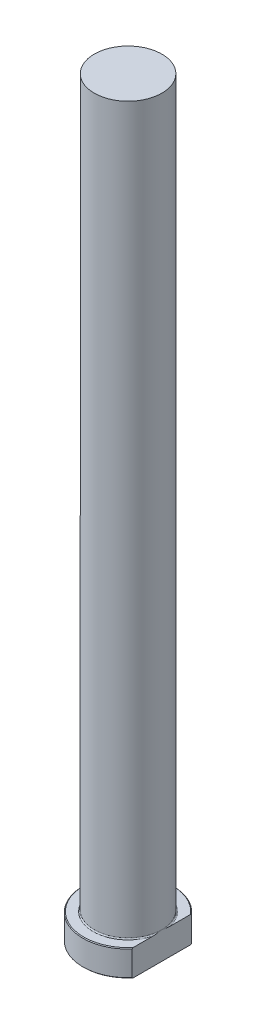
ISO-10303-21;
HEADER;
FILE_DESCRIPTION(('STEP AP214'),'2;1');
FILE_NAME('part.step','',(''),(''),'','','');
FILE_SCHEMA(('AUTOMOTIVE_DESIGN { 1 0 10303 214 1 1 1 1 }'));
ENDSEC;
DATA;
#1=APPLICATION_CONTEXT('core data for automotive mechanical design processes');
#2=APPLICATION_PROTOCOL_DEFINITION('international standard','automotive_design',2000,#1);
#3=PRODUCT_CONTEXT('',#1,'mechanical');
#4=PRODUCT('Part','Part','',(#3));
#5=PRODUCT_RELATED_PRODUCT_CATEGORY('part','',(#4));
#6=PRODUCT_DEFINITION_FORMATION('','',#4);
#7=PRODUCT_DEFINITION_CONTEXT('part definition',#1,'design');
#8=PRODUCT_DEFINITION('design','',#6,#7);
#9=PRODUCT_DEFINITION_SHAPE('','',#8);
#10=(LENGTH_UNIT() NAMED_UNIT(*) SI_UNIT(.MILLI.,.METRE.));
#11=(NAMED_UNIT(*) PLANE_ANGLE_UNIT() SI_UNIT($,.RADIAN.));
#12=(NAMED_UNIT(*) SI_UNIT($,.STERADIAN.) SOLID_ANGLE_UNIT());
#13=UNCERTAINTY_MEASURE_WITH_UNIT(LENGTH_MEASURE(1.E-05),#10,'distance_accuracy_value','');
#14=(GEOMETRIC_REPRESENTATION_CONTEXT(3) GLOBAL_UNCERTAINTY_ASSIGNED_CONTEXT((#13)) GLOBAL_UNIT_ASSIGNED_CONTEXT((#10,
#11,#12)) REPRESENTATION_CONTEXT('',''));
#15=CARTESIAN_POINT('',(0.,0.,0.));
#16=DIRECTION('',(0.,0.,1.));
#17=DIRECTION('',(1.,0.,0.));
#18=AXIS2_PLACEMENT_3D('',#15,#16,#17);
#19=CARTESIAN_POINT('',(0.,0.,0.));
#20=DIRECTION('',(0.,-1.,0.));
#21=DIRECTION('',(0.,0.,-1.));
#22=AXIS2_PLACEMENT_3D('',#19,#20,#21);
#23=PLANE('',#22);
#24=CARTESIAN_POINT('',(0.,0.,0.));
#25=DIRECTION('',(0.,-1.,0.));
#26=DIRECTION('',(0.,0.,-1.));
#27=AXIS2_PLACEMENT_3D('',#24,#25,#26);
#28=CIRCLE('',#27,11.8);
#29=CARTESIAN_POINT('',(8.99999999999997,0.,7.63151361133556));
#30=VERTEX_POINT('',#29);
#31=CARTESIAN_POINT('',(8.99999999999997,0.,-7.63151361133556));
#32=VERTEX_POINT('',#31);
#33=EDGE_CURVE('E98',#30,#32,#28,.T.);
#34=ORIENTED_EDGE('',*,*,#33,.T.);
#35=DIRECTION('',(0.,0.,1.));
#36=VECTOR('',#35,1.);
#37=CARTESIAN_POINT('',(8.99999999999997,0.,-7.93725393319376));
#38=LINE('',#37,#36);
#39=EDGE_CURVE('E83',#32,#30,#38,.T.);
#40=ORIENTED_EDGE('',*,*,#39,.T.);
#41=EDGE_LOOP('',(#34,#40));
#42=FACE_BOUND('',#41,.T.);
#43=ADVANCED_FACE('F32',(#42),#23,.T.);
#44=CARTESIAN_POINT('',(0.,259.958771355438,0.));
#45=DIRECTION('',(0.,1.,0.));
#46=DIRECTION('',(0.,0.,1.));
#47=AXIS2_PLACEMENT_3D('',#44,#45,#46);
#48=CYLINDRICAL_SURFACE('',#47,12.);
#49=CARTESIAN_POINT('',(0.,6.79999999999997,0.));
#50=DIRECTION('',(0.,1.,0.));
#51=DIRECTION('',(0.,0.,1.));
#52=AXIS2_PLACEMENT_3D('',#49,#50,#51);
#53=CIRCLE('',#52,12.);
#54=CARTESIAN_POINT('',(8.99999999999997,6.79999999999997,7.93725393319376));
#55=VERTEX_POINT('',#54);
#56=CARTESIAN_POINT('',(8.99999999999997,6.79999999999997,-7.93725393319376));
#57=VERTEX_POINT('',#56);
#58=EDGE_CURVE('E104',#55,#57,#53,.F.);
#59=ORIENTED_EDGE('',*,*,#58,.T.);
#60=DIRECTION('',(0.,-1.,0.));
#61=VECTOR('',#60,1.);
#62=CARTESIAN_POINT('',(8.99999999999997,200.,-7.93725393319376));
#63=LINE('',#62,#61);
#64=CARTESIAN_POINT('',(8.99999999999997,0.199999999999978,-7.93725393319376));
#65=VERTEX_POINT('',#64);
#66=EDGE_CURVE('E183',#57,#65,#63,.T.);
#67=ORIENTED_EDGE('',*,*,#66,.T.);
#68=CARTESIAN_POINT('',(0.,0.199999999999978,0.));
#69=DIRECTION('',(0.,-1.,0.));
#70=DIRECTION('',(0.,0.,-1.));
#71=AXIS2_PLACEMENT_3D('',#68,#69,#70);
#72=CIRCLE('',#71,12.);
#73=CARTESIAN_POINT('',(8.99999999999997,0.199999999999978,7.93725393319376));
#74=VERTEX_POINT('',#73);
#75=EDGE_CURVE('E100',#65,#74,#72,.F.);
#76=ORIENTED_EDGE('',*,*,#75,.T.);
#77=DIRECTION('',(0.,-1.,0.));
#78=VECTOR('',#77,1.);
#79=CARTESIAN_POINT('',(8.99999999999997,200.,7.93725393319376));
#80=LINE('',#79,#78);
#81=EDGE_CURVE('E93',#55,#74,#80,.T.);
#82=ORIENTED_EDGE('',*,*,#81,.F.);
#83=EDGE_LOOP('',(#59,#67,#76,#82));
#84=FACE_BOUND('',#83,.T.);
#85=ADVANCED_FACE('F158',(#84),#48,.T.);
#86=CARTESIAN_POINT('',(-12.,7.,0.));
#87=DIRECTION('',(0.,1.,0.));
#88=DIRECTION('',(0.,0.,1.));
#89=AXIS2_PLACEMENT_3D('',#86,#87,#88);
#90=PLANE('',#89);
#91=CARTESIAN_POINT('',(0.,7.,0.));
#92=DIRECTION('',(0.,1.,0.));
#93=DIRECTION('',(0.,0.,1.));
#94=AXIS2_PLACEMENT_3D('',#91,#92,#93);
#95=CIRCLE('',#94,11.8);
#96=CARTESIAN_POINT('',(8.99999999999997,7.,-7.63151361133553));
#97=VERTEX_POINT('',#96);
#98=CARTESIAN_POINT('',(8.99999999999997,7.,7.63151361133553));
#99=VERTEX_POINT('',#98);
#100=EDGE_CURVE('E178',#97,#99,#95,.T.);
#101=ORIENTED_EDGE('',*,*,#100,.T.);
#102=DIRECTION('',(0.,0.,-1.));
#103=VECTOR('',#102,1.);
#104=CARTESIAN_POINT('',(8.99999999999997,7.,0.));
#105=LINE('',#104,#103);
#106=CARTESIAN_POINT('',(8.99999999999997,6.99999999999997,2.34307490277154));
#107=VERTEX_POINT('',#106);
#108=EDGE_CURVE('E57',#99,#107,#105,.T.);
#109=ORIENTED_EDGE('',*,*,#108,.T.);
#110=CARTESIAN_POINT('',(0.,7.,0.));
#111=DIRECTION('',(0.,1.,0.));
#112=DIRECTION('',(0.,0.,1.));
#113=AXIS2_PLACEMENT_3D('',#110,#111,#112);
#114=CIRCLE('',#113,9.29999999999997);
#115=CARTESIAN_POINT('',(8.99999999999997,6.99999999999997,-2.34307490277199));
#116=VERTEX_POINT('',#115);
#117=EDGE_CURVE('E107',#107,#116,#114,.F.);
#118=ORIENTED_EDGE('',*,*,#117,.T.);
#119=EDGE_CURVE('E136',#116,#97,#105,.T.);
#120=ORIENTED_EDGE('',*,*,#119,.T.);
#121=EDGE_LOOP('',(#101,#109,#118,#120));
#122=FACE_BOUND('',#121,.T.);
#123=ADVANCED_FACE('F147',(#122),#90,.T.);
#124=CARTESIAN_POINT('',(0.,7.00000000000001,0.));
#125=DIRECTION('',(0.,-1.,0.));
#126=DIRECTION('',(0.,0.,-1.));
#127=AXIS2_PLACEMENT_3D('',#124,#125,#126);
#128=CONICAL_SURFACE('',#127,11.7999999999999,0.785398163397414);
#129=ORIENTED_EDGE('',*,*,#58,.F.);
#130=CARTESIAN_POINT('',(8.99999999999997,-0.845696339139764,17.4629145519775));
#131=CARTESIAN_POINT('',(8.99999999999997,-0.619168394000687,17.2080654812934));
#132=CARTESIAN_POINT('',(8.99999999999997,-0.393215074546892,16.9527052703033));
#133=CARTESIAN_POINT('',(8.99999999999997,0.0573779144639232,16.4408231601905));
#134=CARTESIAN_POINT('',(8.99999999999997,0.282017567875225,16.1843012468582));
#135=CARTESIAN_POINT('',(8.99999999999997,0.953874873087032,15.4126051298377));
#136=CARTESIAN_POINT('',(8.99999999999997,1.39886493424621,14.8954867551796));
#137=CARTESIAN_POINT('',(8.99999999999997,2.28707339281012,13.8475750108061));
#138=CARTESIAN_POINT('',(8.99999999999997,2.73018564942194,13.3166913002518));
#139=CARTESIAN_POINT('',(8.99999999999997,3.38667359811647,12.5137605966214));
#140=CARTESIAN_POINT('',(8.99999999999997,3.60411991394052,12.2450411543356));
#141=CARTESIAN_POINT('',(8.99999999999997,4.03580182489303,11.7050379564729));
#142=CARTESIAN_POINT('',(8.99999999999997,4.25003746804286,11.4337542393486));
#143=CARTESIAN_POINT('',(8.99999999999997,4.66485476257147,10.9008707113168));
#144=CARTESIAN_POINT('',(8.99999999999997,4.8656088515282,10.6394052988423));
#145=CARTESIAN_POINT('',(8.99999999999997,5.26299613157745,10.1133666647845));
#146=CARTESIAN_POINT('',(8.99999999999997,5.45962943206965,9.84879352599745));
#147=CARTESIAN_POINT('',(8.99999999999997,5.84808590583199,9.31586751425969));
#148=CARTESIAN_POINT('',(8.99999999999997,6.039905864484,9.04751229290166));
#149=CARTESIAN_POINT('',(8.99999999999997,6.41755379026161,8.5066135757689));
#150=CARTESIAN_POINT('',(8.99999999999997,6.60338186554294,8.23407015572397));
#151=CARTESIAN_POINT('',(8.99999999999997,6.96709703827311,7.68503423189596));
#152=CARTESIAN_POINT('',(8.99999999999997,7.14500871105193,7.40855806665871));
#153=CARTESIAN_POINT('',(8.99999999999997,7.49185621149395,6.84996824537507));
#154=CARTESIAN_POINT('',(8.99999999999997,7.66079116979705,6.56785404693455));
#155=CARTESIAN_POINT('',(8.99999999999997,7.98727106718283,5.99747808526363));
#156=CARTESIAN_POINT('',(8.99999999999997,8.14482812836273,5.70922330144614));
#157=CARTESIAN_POINT('',(8.99999999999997,8.4458607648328,5.12549650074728));
#158=CARTESIAN_POINT('',(8.99999999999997,8.58934045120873,4.83002662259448));
#159=CARTESIAN_POINT('',(8.99999999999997,8.84906483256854,4.25238874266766));
#160=CARTESIAN_POINT('',(8.99999999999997,8.96652090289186,3.97076984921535));
#161=CARTESIAN_POINT('',(8.99999999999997,9.1826864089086,3.40034514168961));
#162=CARTESIAN_POINT('',(8.99999999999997,9.28139598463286,3.1115393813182));
#163=CARTESIAN_POINT('',(8.99999999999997,9.4556676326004,2.52852903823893));
#164=CARTESIAN_POINT('',(8.99999999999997,9.53134480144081,2.23435935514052));
#165=CARTESIAN_POINT('',(8.99999999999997,9.65632576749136,1.64041484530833));
#166=CARTESIAN_POINT('',(8.99999999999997,9.70563300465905,1.34064075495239));
#167=CARTESIAN_POINT('',(8.99999999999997,9.77526514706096,0.73345334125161));
#168=CARTESIAN_POINT('',(8.99999999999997,9.79517814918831,0.425991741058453));
#169=CARTESIAN_POINT('',(8.99999999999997,9.80326622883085,-0.189338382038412));
#170=CARTESIAN_POINT('',(8.99999999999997,9.7914430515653,-0.497206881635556));
#171=CARTESIAN_POINT('',(8.99999999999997,9.73685194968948,-1.11106012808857));
#172=CARTESIAN_POINT('',(8.99999999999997,9.69399186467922,-1.41703652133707));
#173=CARTESIAN_POINT('',(8.99999999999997,9.58011156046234,-2.02367348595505));
#174=CARTESIAN_POINT('',(8.99999999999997,9.50908374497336,-2.32433260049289));
#175=CARTESIAN_POINT('',(8.99999999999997,9.31275981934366,-3.02635448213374));
#176=CARTESIAN_POINT('',(8.99999999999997,9.17712713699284,-3.42480429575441));
#177=CARTESIAN_POINT('',(8.99999999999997,8.87133996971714,-4.20817933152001));
#178=CARTESIAN_POINT('',(8.99999999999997,8.70116358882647,-4.59309579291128));
#179=CARTESIAN_POINT('',(8.99999999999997,8.42568509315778,-5.16277807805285));
#180=CARTESIAN_POINT('',(8.99999999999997,8.32997694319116,-5.3522881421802));
#181=CARTESIAN_POINT('',(8.99999999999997,8.13285287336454,-5.72832390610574));
#182=CARTESIAN_POINT('',(8.99999999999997,8.03143692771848,-5.91484959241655));
#183=CARTESIAN_POINT('',(8.99999999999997,7.8237269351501,-6.28506428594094));
#184=CARTESIAN_POINT('',(8.99999999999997,7.71743466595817,-6.46875429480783));
#185=CARTESIAN_POINT('',(8.99999999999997,7.50059460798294,-6.83359939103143));
#186=CARTESIAN_POINT('',(8.99999999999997,7.39004682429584,-7.01475448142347));
#187=CARTESIAN_POINT('',(8.99999999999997,7.12884885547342,-7.4330641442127));
#188=CARTESIAN_POINT('',(8.99999999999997,6.9768081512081,-7.66934990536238));
#189=CARTESIAN_POINT('',(8.99999999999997,6.66732030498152,-8.13836281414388));
#190=CARTESIAN_POINT('',(8.99999999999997,6.50987281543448,-8.37108973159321));
#191=CARTESIAN_POINT('',(8.99999999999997,6.19040265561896,-8.83345273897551));
#192=CARTESIAN_POINT('',(8.99999999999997,6.02837897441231,-9.06308812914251));
#193=CARTESIAN_POINT('',(8.99999999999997,5.70047733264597,-9.51959402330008));
#194=CARTESIAN_POINT('',(8.99999999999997,5.53459926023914,-9.74646444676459));
#195=CARTESIAN_POINT('',(8.99999999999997,5.03154469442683,-10.4241247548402));
#196=CARTESIAN_POINT('',(8.99999999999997,4.68944039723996,-10.8712583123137));
#197=CARTESIAN_POINT('',(8.99999999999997,3.9955806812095,-11.7578381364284));
#198=CARTESIAN_POINT('',(8.99999999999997,3.64382644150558,-12.1972853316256));
#199=CARTESIAN_POINT('',(8.99999999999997,2.95317269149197,-13.0452636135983));
#200=CARTESIAN_POINT('',(8.99999999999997,2.61468309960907,-13.4541293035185));
#201=CARTESIAN_POINT('',(8.99999999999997,1.93249184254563,-14.2675092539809));
#202=CARTESIAN_POINT('',(8.99999999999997,1.58878996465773,-14.6720233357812));
#203=CARTESIAN_POINT('',(8.99999999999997,0.898519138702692,-15.4759626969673));
#204=CARTESIAN_POINT('',(8.99999999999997,0.551965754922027,-15.8754013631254));
#205=CARTESIAN_POINT('',(8.99999999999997,-0.144511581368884,-16.6712645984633));
#206=CARTESIAN_POINT('',(8.99999999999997,-0.494435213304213,-17.0676894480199));
#207=CARTESIAN_POINT('',(8.99999999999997,-0.845696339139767,-17.4629145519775));
#208=B_SPLINE_CURVE_WITH_KNOTS('',3,(#130,#131,#132,#133,#134,#135,#136,#137,#138,#139,#140,
#141,#142,#143,#144,#145,#146,#147,#148,#149,#150,#151,#152,#153,#154,#155,#156,#157,#158,#159,
#160,#161,#162,#163,#164,#165,#166,#167,#168,#169,#170,#171,#172,#173,#174,#175,#176,#177,#178,
#179,#180,#181,#182,#183,#184,#185,#186,#187,#188,#189,#190,#191,#192,#193,#194,#195,#196,#197,
#198,#199,#200,#201,#202,#203,#204,#205,#206,#207),.UNSPECIFIED.,.F.,.F.,(4,2,2,2,2,2,2,2,2,2,2,
2,2,2,2,2,2,2,2,2,2,2,2,2,2,2,2,2,2,2,2,2,2,2,2,2,2,2,4),(0.,1.02291971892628,2.04585198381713,
4.09246471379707,6.16687312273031,7.20388686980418,8.24088509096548,9.22978878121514,
10.2186661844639,11.2081873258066,12.197690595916,13.1838703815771,14.1701455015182,
15.1553538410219,16.1402736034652,17.0551241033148,17.9699677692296,18.8801617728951,
19.7902370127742,20.7129479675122,21.6356081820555,22.5610194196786,23.4866803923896,
24.7471780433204,26.0084771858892,26.6453205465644,27.2821667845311,27.9187826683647,
28.5553977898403,29.3982316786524,30.2411198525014,31.0841957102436,31.9272960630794,
33.6160766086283,35.3046517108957,36.8969911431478,38.4893957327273,40.0758348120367,
41.6621244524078),.UNSPECIFIED.);
#209=EDGE_CURVE('E135',#55,#99,#208,.T.);
#210=ORIENTED_EDGE('',*,*,#209,.T.);
#211=ORIENTED_EDGE('',*,*,#100,.F.);
#212=EDGE_CURVE('E127',#97,#57,#208,.T.);
#213=ORIENTED_EDGE('',*,*,#212,.T.);
#214=EDGE_LOOP('',(#129,#210,#211,#213));
#215=FACE_BOUND('',#214,.T.);
#216=ADVANCED_FACE('F143',(#215),#128,.T.);
#217=CARTESIAN_POINT('',(0.,0.199999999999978,0.));
#218=DIRECTION('',(0.,1.,0.));
#219=DIRECTION('',(0.,0.,1.));
#220=AXIS2_PLACEMENT_3D('',#217,#218,#219);
#221=CONICAL_SURFACE('',#220,12.,0.785398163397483);
#222=ORIENTED_EDGE('',*,*,#75,.F.);
#223=CARTESIAN_POINT('',(8.99999999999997,7.84569633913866,-17.4629145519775));
#224=CARTESIAN_POINT('',(8.99999999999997,7.61916839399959,-17.2080654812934));
#225=CARTESIAN_POINT('',(8.99999999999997,7.3932150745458,-16.9527052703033));
#226=CARTESIAN_POINT('',(8.99999999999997,6.94262208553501,-16.4408231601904));
#227=CARTESIAN_POINT('',(8.99999999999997,6.71798243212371,-16.1843012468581));
#228=CARTESIAN_POINT('',(8.99999999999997,6.04612512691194,-15.4126051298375));
#229=CARTESIAN_POINT('',(8.99999999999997,5.60113506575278,-14.8954867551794));
#230=CARTESIAN_POINT('',(8.99999999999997,4.71292660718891,-13.8475750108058));
#231=CARTESIAN_POINT('',(8.99999999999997,4.26981435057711,-13.3166913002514));
#232=CARTESIAN_POINT('',(8.99999999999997,3.6133264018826,-12.5137605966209));
#233=CARTESIAN_POINT('',(8.99999999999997,3.39588008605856,-12.245041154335));
#234=CARTESIAN_POINT('',(8.99999999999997,2.96419817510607,-11.7050379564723));
#235=CARTESIAN_POINT('',(8.99999999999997,2.74996253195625,-11.4337542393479));
#236=CARTESIAN_POINT('',(8.99999999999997,2.33514523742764,-10.9008707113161));
#237=CARTESIAN_POINT('',(8.99999999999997,2.1343911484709,-10.6394052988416));
#238=CARTESIAN_POINT('',(8.99999999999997,1.73700386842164,-10.1133666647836));
#239=CARTESIAN_POINT('',(8.99999999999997,1.54037056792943,-9.84879352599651));
#240=CARTESIAN_POINT('',(8.99999999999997,1.15191409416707,-9.31586751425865));
#241=CARTESIAN_POINT('',(8.99999999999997,0.960094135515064,-9.04751229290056));
#242=CARTESIAN_POINT('',(8.99999999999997,0.582446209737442,-8.50661357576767));
#243=CARTESIAN_POINT('',(8.99999999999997,0.396618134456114,-8.23407015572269));
#244=CARTESIAN_POINT('',(8.99999999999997,0.032902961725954,-7.68503423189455));
#245=CARTESIAN_POINT('',(8.99999999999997,-0.145008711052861,-7.40855806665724));
#246=CARTESIAN_POINT('',(8.99999999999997,-0.49185621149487,-6.84996824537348));
#247=CARTESIAN_POINT('',(8.99999999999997,-0.660791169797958,-6.5678540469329));
#248=CARTESIAN_POINT('',(8.99999999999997,-0.987271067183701,-5.99747808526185));
#249=CARTESIAN_POINT('',(8.99999999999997,-1.14482812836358,-5.7092233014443));
#250=CARTESIAN_POINT('',(8.99999999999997,-1.4458607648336,-5.1254965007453));
#251=CARTESIAN_POINT('',(8.99999999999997,-1.5893404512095,-4.83002662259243));
#252=CARTESIAN_POINT('',(8.99999999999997,-1.84906483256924,-4.25238874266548));
#253=CARTESIAN_POINT('',(8.99999999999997,-1.96652090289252,-3.97076984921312));
#254=CARTESIAN_POINT('',(8.99999999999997,-2.18268640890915,-3.40034514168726));
#255=CARTESIAN_POINT('',(8.99999999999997,-2.28139598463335,-3.11153938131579));
#256=CARTESIAN_POINT('',(8.99999999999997,-2.45566763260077,-2.52852903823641));
#257=CARTESIAN_POINT('',(8.99999999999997,-2.53134480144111,-2.23435935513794));
#258=CARTESIAN_POINT('',(8.99999999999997,-2.6563257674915,-1.64041484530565));
#259=CARTESIAN_POINT('',(8.99999999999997,-2.7056330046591,-1.34064075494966));
#260=CARTESIAN_POINT('',(8.99999999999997,-2.77526514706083,-0.733453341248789));
#261=CARTESIAN_POINT('',(8.99999999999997,-2.79517814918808,-0.425991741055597));
#262=CARTESIAN_POINT('',(8.99999999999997,-2.80326622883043,0.18933838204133));
#263=CARTESIAN_POINT('',(8.99999999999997,-2.79144305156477,0.4972068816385));
#264=CARTESIAN_POINT('',(8.99999999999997,-2.73685194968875,1.11106012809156));
#265=CARTESIAN_POINT('',(8.99999999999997,-2.6939918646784,1.41703652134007));
#266=CARTESIAN_POINT('',(8.99999999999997,-2.58011156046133,2.02367348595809));
#267=CARTESIAN_POINT('',(8.99999999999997,-2.50908374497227,2.32433260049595));
#268=CARTESIAN_POINT('',(8.99999999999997,-2.3127598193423,3.02635448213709));
#269=CARTESIAN_POINT('',(8.99999999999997,-2.17712713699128,3.42480429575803));
#270=CARTESIAN_POINT('',(8.99999999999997,-1.87133996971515,4.20817933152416));
#271=CARTESIAN_POINT('',(8.99999999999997,-1.70116358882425,4.5930957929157));
#272=CARTESIAN_POINT('',(8.99999999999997,-1.42568509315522,5.16277807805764));
#273=CARTESIAN_POINT('',(8.99999999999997,-1.32997694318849,5.35228814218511));
#274=CARTESIAN_POINT('',(8.99999999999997,-1.13285287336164,5.7283239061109));
#275=CARTESIAN_POINT('',(8.99999999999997,-1.03143692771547,5.91484959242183));
#276=CARTESIAN_POINT('',(8.99999999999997,-0.823726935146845,6.28506428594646));
#277=CARTESIAN_POINT('',(8.99999999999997,-0.717434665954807,6.46875429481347));
#278=CARTESIAN_POINT('',(8.99999999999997,-0.500594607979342,6.8335993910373));
#279=CARTESIAN_POINT('',(8.99999999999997,-0.390046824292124,7.01475448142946));
#280=CARTESIAN_POINT('',(8.99999999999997,-0.128848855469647,7.43306414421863));
#281=CARTESIAN_POINT('',(8.99999999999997,0.0231918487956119,7.66934990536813));
#282=CARTESIAN_POINT('',(8.99999999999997,0.33267969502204,8.13836281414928));
#283=CARTESIAN_POINT('',(8.99999999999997,0.490127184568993,8.37108973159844));
#284=CARTESIAN_POINT('',(8.99999999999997,0.80959734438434,8.83345273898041));
#285=CARTESIAN_POINT('',(8.99999999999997,0.971621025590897,9.06308812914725));
#286=CARTESIAN_POINT('',(8.99999999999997,1.29952266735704,9.51959402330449));
#287=CARTESIAN_POINT('',(8.99999999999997,1.46540073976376,9.74646444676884));
#288=CARTESIAN_POINT('',(8.99999999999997,1.96845530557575,10.424124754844));
#289=CARTESIAN_POINT('',(8.99999999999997,2.31055960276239,10.8712583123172));
#290=CARTESIAN_POINT('',(8.99999999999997,3.00441931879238,11.7578381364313));
#291=CARTESIAN_POINT('',(8.99999999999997,3.35617355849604,12.1972853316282));
#292=CARTESIAN_POINT('',(8.99999999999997,4.04682730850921,13.0452636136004));
#293=CARTESIAN_POINT('',(8.99999999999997,4.3853169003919,13.4541293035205));
#294=CARTESIAN_POINT('',(8.99999999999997,5.06750815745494,14.2675092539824));
#295=CARTESIAN_POINT('',(8.99999999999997,5.41121003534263,14.6720233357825));
#296=CARTESIAN_POINT('',(8.99999999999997,6.10148086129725,15.4759626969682));
#297=CARTESIAN_POINT('',(8.99999999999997,6.4480342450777,15.8754013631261));
#298=CARTESIAN_POINT('',(8.99999999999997,7.1445115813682,16.6712645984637));
#299=CARTESIAN_POINT('',(8.99999999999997,7.49443521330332,17.0676894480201));
#300=CARTESIAN_POINT('',(8.99999999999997,7.84569633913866,17.4629145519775));
#301=B_SPLINE_CURVE_WITH_KNOTS('',3,(#223,#224,#225,#226,#227,#228,#229,#230,#231,#232,#233,
#234,#235,#236,#237,#238,#239,#240,#241,#242,#243,#244,#245,#246,#247,#248,#249,#250,#251,#252,
#253,#254,#255,#256,#257,#258,#259,#260,#261,#262,#263,#264,#265,#266,#267,#268,#269,#270,#271,
#272,#273,#274,#275,#276,#277,#278,#279,#280,#281,#282,#283,#284,#285,#286,#287,#288,#289,#290,
#291,#292,#293,#294,#295,#296,#297,#298,#299,#300),.UNSPECIFIED.,.F.,.F.,(4,2,2,2,2,2,2,2,2,2,2,
2,2,2,2,2,2,2,2,2,2,2,2,2,2,2,2,2,2,2,2,2,2,2,2,2,2,2,4),(0.,1.02291971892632,2.04585198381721,
4.09246471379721,6.16687312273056,7.20388686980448,8.24088509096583,9.22978878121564,
10.2186661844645,11.2081873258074,12.1976905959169,13.1838703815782,14.1701455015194,
15.1553538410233,16.1402736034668,17.0551241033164,17.9699677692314,18.8801617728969,
19.7902370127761,20.7129479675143,21.6356081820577,22.5610194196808,23.486680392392,
24.7471780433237,26.0084771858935,26.6453205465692,27.2821667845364,27.9187826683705,
28.5553977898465,29.3982316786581,30.2411198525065,31.0841957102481,31.9272960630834,
33.6160766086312,35.3046517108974,36.8969911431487,38.4893957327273,40.0758348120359,
41.6621244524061),.UNSPECIFIED.);
#302=EDGE_CURVE('E86',#65,#32,#301,.T.);
#303=ORIENTED_EDGE('',*,*,#302,.T.);
#304=ORIENTED_EDGE('',*,*,#33,.F.);
#305=EDGE_CURVE('E89',#30,#74,#301,.T.);
#306=ORIENTED_EDGE('',*,*,#305,.T.);
#307=EDGE_LOOP('',(#222,#303,#304,#306));
#308=FACE_BOUND('',#307,.T.);
#309=ADVANCED_FACE('F97',(#308),#221,.T.);
#310=CARTESIAN_POINT('',(0.,7.29999999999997,0.));
#311=DIRECTION('',(0.,1.,0.));
#312=DIRECTION('',(0.,0.,1.));
#313=AXIS2_PLACEMENT_3D('',#310,#311,#312);
#314=TOROIDAL_SURFACE('',#313,9.29999999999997,0.3);
#315=CARTESIAN_POINT('',(8.99999999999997,7.29999999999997,0.));
#316=CARTESIAN_POINT('',(8.99999999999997,7.30000063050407,1.40628521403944E-10));
#317=CARTESIAN_POINT('',(8.99999999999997,7.30000126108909,-3.72953344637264E-07));
#318=CARTESIAN_POINT('',(8.99999999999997,7.30000242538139,-1.31879172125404E-06));
#319=CARTESIAN_POINT('',(8.99999999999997,7.30000291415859,-1.91658985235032E-06));
#320=CARTESIAN_POINT('',(8.99999999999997,7.30000399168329,-3.38116402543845E-06));
#321=CARTESIAN_POINT('',(8.99999999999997,7.30000455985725,-4.27141237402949E-06));
#322=CARTESIAN_POINT('',(8.99999999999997,7.30000552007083,-6.05655817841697E-06));
#323=CARTESIAN_POINT('',(8.99999999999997,7.30000592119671,-6.9473471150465E-06));
#324=CARTESIAN_POINT('',(8.99999999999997,7.30000753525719,-1.06072217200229E-05));
#325=CARTESIAN_POINT('',(8.99999999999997,7.30000869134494,-1.34079715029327E-05));
#326=CARTESIAN_POINT('',(8.99999999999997,7.30001046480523,-1.87883419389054E-05));
#327=CARTESIAN_POINT('',(8.99999999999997,7.30001113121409,-2.13522964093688E-05));
#328=CARTESIAN_POINT('',(8.99999999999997,7.30001412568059,-3.27400407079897E-05));
#329=CARTESIAN_POINT('',(8.99999999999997,7.30001653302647,-4.15431816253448E-05));
#330=CARTESIAN_POINT('',(8.99999999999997,7.30001987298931,-5.77938726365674E-05));
#331=CARTESIAN_POINT('',(8.99999999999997,7.3000209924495,-6.5202010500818E-05));
#332=CARTESIAN_POINT('',(8.99999999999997,7.30002942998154,-0.000121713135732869));
#333=CARTESIAN_POINT('',(8.99999999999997,7.30003617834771,-0.000170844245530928));
#334=CARTESIAN_POINT('',(8.99999999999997,7.30006567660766,-0.00036702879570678));
#335=CARTESIAN_POINT('',(8.99999999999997,7.30009343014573,-0.00051334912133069));
#336=CARTESIAN_POINT('',(8.99999999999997,7.30020289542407,-0.00109844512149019));
#337=CARTESIAN_POINT('',(8.99999999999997,7.30028164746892,-0.00153755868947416));
#338=CARTESIAN_POINT('',(8.99999999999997,7.30059984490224,-0.00330079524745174));
#339=CARTESIAN_POINT('',(8.99999999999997,7.30084318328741,-0.00462444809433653));
#340=CARTESIAN_POINT('',(8.99999999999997,7.30186346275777,-0.0101867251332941));
#341=CARTESIAN_POINT('',(8.99999999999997,7.30263548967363,-0.0144259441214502));
#342=CARTESIAN_POINT('',(8.99999999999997,7.31325744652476,-0.0727359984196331));
#343=CARTESIAN_POINT('',(8.99999999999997,7.32313962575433,-0.1268031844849));
#344=CARTESIAN_POINT('',(8.99999999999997,7.34392153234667,-0.241097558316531));
#345=CARTESIAN_POINT('',(8.99999999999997,7.35480932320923,-0.301326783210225));
#346=CARTESIAN_POINT('',(8.99999999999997,7.37309736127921,-0.40343148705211));
#347=CARTESIAN_POINT('',(8.99999999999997,7.3805477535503,-0.445297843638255));
#348=CARTESIAN_POINT('',(8.99999999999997,7.39510453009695,-0.527858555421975));
#349=CARTESIAN_POINT('',(8.99999999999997,7.40221466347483,-0.568552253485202));
#350=CARTESIAN_POINT('',(8.99999999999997,7.43458159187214,-0.755924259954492));
#351=CARTESIAN_POINT('',(8.99999999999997,7.45890071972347,-0.902767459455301));
#352=CARTESIAN_POINT('',(8.99999999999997,7.5040883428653,-1.19870226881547));
#353=CARTESIAN_POINT('',(8.99999999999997,7.52491482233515,-1.34780055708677));
#354=CARTESIAN_POINT('',(8.99999999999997,7.55251893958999,-1.57943061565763));
#355=CARTESIAN_POINT('',(8.99999999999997,7.56140010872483,-1.66170929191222));
#356=CARTESIAN_POINT('',(8.99999999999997,7.57684365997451,-1.82648173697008));
#357=CARTESIAN_POINT('',(8.99999999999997,7.58340627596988,-1.90897548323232));
#358=CARTESIAN_POINT('',(8.99999999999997,7.59356547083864,-2.07383798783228));
#359=CARTESIAN_POINT('',(8.99999999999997,7.59717316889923,-2.15620603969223));
#360=CARTESIAN_POINT('',(8.99999999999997,7.60060935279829,-2.32101209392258));
#361=CARTESIAN_POINT('',(8.99999999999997,7.60043940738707,-2.40345005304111));
#362=CARTESIAN_POINT('',(8.99999999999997,7.59640131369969,-2.52537573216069));
#363=CARTESIAN_POINT('',(8.99999999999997,7.59450012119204,-2.56492910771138));
#364=CARTESIAN_POINT('',(8.99999999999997,7.58928802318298,-2.64396909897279));
#365=CARTESIAN_POINT('',(8.99999999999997,7.58597630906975,-2.68345566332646));
#366=CARTESIAN_POINT('',(8.99999999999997,7.57769868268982,-2.76177296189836));
#367=CARTESIAN_POINT('',(8.99999999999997,7.57275348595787,-2.80060581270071));
#368=CARTESIAN_POINT('',(8.99999999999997,7.56078540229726,-2.87793166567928));
#369=CARTESIAN_POINT('',(8.99999999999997,7.55376374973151,-2.91642485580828));
#370=CARTESIAN_POINT('',(8.99999999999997,7.53694450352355,-2.99313780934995));
#371=CARTESIAN_POINT('',(8.99999999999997,7.52712658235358,-3.03135338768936));
#372=CARTESIAN_POINT('',(8.99999999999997,7.50944673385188,-3.08780831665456));
#373=CARTESIAN_POINT('',(8.99999999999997,7.50305127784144,-3.10650508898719));
#374=CARTESIAN_POINT('',(8.99999999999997,7.48902548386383,-3.14342466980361));
#375=CARTESIAN_POINT('',(8.99999999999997,7.48139609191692,-3.16164782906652));
#376=CARTESIAN_POINT('',(8.99999999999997,7.46450585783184,-3.19743301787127));
#377=CARTESIAN_POINT('',(8.99999999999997,7.4552376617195,-3.2149916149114));
#378=CARTESIAN_POINT('',(8.99999999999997,7.43454972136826,-3.24876333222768));
#379=CARTESIAN_POINT('',(8.99999999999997,7.42314087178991,-3.26498269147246));
#380=CARTESIAN_POINT('',(8.99999999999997,7.40450419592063,-3.28646803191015));
#381=CARTESIAN_POINT('',(8.99999999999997,7.39850345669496,-3.29278935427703));
#382=CARTESIAN_POINT('',(8.99999999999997,7.38579421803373,-3.30471156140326));
#383=CARTESIAN_POINT('',(8.99999999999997,7.37908470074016,-3.31031138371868));
#384=CARTESIAN_POINT('',(8.99999999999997,7.36478588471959,-3.32053638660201));
#385=CARTESIAN_POINT('',(8.99999999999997,7.35718475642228,-3.32514544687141));
#386=CARTESIAN_POINT('',(8.99999999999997,7.34122980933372,-3.33278362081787));
#387=CARTESIAN_POINT('',(8.99999999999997,7.33287931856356,-3.33581935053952));
#388=CARTESIAN_POINT('',(8.99999999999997,7.31845330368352,-3.33919143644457));
#389=CARTESIAN_POINT('',(8.99999999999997,7.3125065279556,-3.34008113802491));
#390=CARTESIAN_POINT('',(8.99999999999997,7.30054756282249,-3.34082795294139));
#391=CARTESIAN_POINT('',(8.99999999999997,7.29453539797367,-3.34068544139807));
#392=CARTESIAN_POINT('',(8.99999999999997,7.28263753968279,-3.33938340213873));
#393=CARTESIAN_POINT('',(8.99999999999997,7.2767516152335,-3.3382259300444));
#394=CARTESIAN_POINT('',(8.99999999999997,7.26523345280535,-3.33500803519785));
#395=CARTESIAN_POINT('',(8.99999999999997,7.25960143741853,-3.33294683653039));
#396=CARTESIAN_POINT('',(8.99999999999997,7.24614810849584,-3.32695048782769));
#397=CARTESIAN_POINT('',(8.99999999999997,7.23851777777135,-3.32258952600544));
#398=CARTESIAN_POINT('',(8.99999999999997,7.22402940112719,-3.31273429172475));
#399=CARTESIAN_POINT('',(8.99999999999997,7.21717355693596,-3.3072369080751));
#400=CARTESIAN_POINT('',(8.99999999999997,7.19922025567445,-3.29098261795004));
#401=CARTESIAN_POINT('',(8.99999999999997,7.18887056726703,-3.27940951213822));
#402=CARTESIAN_POINT('',(8.99999999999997,7.16988044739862,-3.25496698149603));
#403=CARTESIAN_POINT('',(8.99999999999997,7.16124389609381,-3.24209471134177));
#404=CARTESIAN_POINT('',(8.99999999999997,7.14198013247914,-3.2101081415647));
#405=CARTESIAN_POINT('',(8.99999999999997,7.1320002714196,-3.1906083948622));
#406=CARTESIAN_POINT('',(8.99999999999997,7.11389041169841,-3.15075380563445));
#407=CARTESIAN_POINT('',(8.99999999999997,7.10576438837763,-3.13039723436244));
#408=CARTESIAN_POINT('',(8.99999999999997,7.09086324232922,-3.08897345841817));
#409=CARTESIAN_POINT('',(8.99999999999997,7.08410231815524,-3.06790120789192));
#410=CARTESIAN_POINT('',(8.99999999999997,7.07174209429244,-3.02545099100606));
#411=CARTESIAN_POINT('',(8.99999999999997,7.06614150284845,-3.00407339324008));
#412=CARTESIAN_POINT('',(8.99999999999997,7.05234584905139,-2.94629140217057));
#413=CARTESIAN_POINT('',(8.99999999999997,7.04502112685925,-2.90967972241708));
#414=CARTESIAN_POINT('',(8.99999999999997,7.03240402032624,-2.8361022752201));
#415=CARTESIAN_POINT('',(8.99999999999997,7.02711280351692,-2.79913631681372));
#416=CARTESIAN_POINT('',(8.99999999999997,7.01363050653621,-2.68772710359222));
#417=CARTESIAN_POINT('',(8.99999999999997,7.00787651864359,-2.61298996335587));
#418=CARTESIAN_POINT('',(8.99999999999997,7.00101064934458,-2.46619763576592));
#419=CARTESIAN_POINT('',(8.99999999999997,6.99973066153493,-2.39414846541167));
#420=CARTESIAN_POINT('',(8.99999999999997,7.0003597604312,-2.25048360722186));
#421=CARTESIAN_POINT('',(8.99999999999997,7.00225057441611,-2.17886780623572));
#422=CARTESIAN_POINT('',(8.99999999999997,7.00865827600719,-2.0325544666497));
#423=CARTESIAN_POINT('',(8.99999999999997,7.01328875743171,-1.95786225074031));
#424=CARTESIAN_POINT('',(8.99999999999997,7.0247141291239,-1.80868969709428));
#425=CARTESIAN_POINT('',(8.99999999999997,7.03150781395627,-1.73420926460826));
#426=CARTESIAN_POINT('',(8.99999999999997,7.04702589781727,-1.583650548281));
#427=CARTESIAN_POINT('',(8.99999999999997,7.05579262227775,-1.50757669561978));
#428=CARTESIAN_POINT('',(8.99999999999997,7.07482366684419,-1.35540828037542));
#429=CARTESIAN_POINT('',(8.99999999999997,7.08509200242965,-1.27931422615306));
#430=CARTESIAN_POINT('',(8.99999999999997,7.11096614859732,-1.09814766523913));
#431=CARTESIAN_POINT('',(8.99999999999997,7.12710877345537,-0.993152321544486));
#432=CARTESIAN_POINT('',(8.99999999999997,7.16076002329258,-0.784642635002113));
#433=CARTESIAN_POINT('',(8.99999999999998,7.17825049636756,-0.681125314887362));
#434=CARTESIAN_POINT('',(8.99999999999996,7.21207189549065,-0.486473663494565));
#435=CARTESIAN_POINT('',(8.99999999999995,7.22829584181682,-0.395320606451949));
#436=CARTESIAN_POINT('',(8.99999999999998,7.25335230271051,-0.256199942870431));
#437=CARTESIAN_POINT('',(9.,7.26204965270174,-0.208207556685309));
#438=CARTESIAN_POINT('',(8.99999999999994,7.27937243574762,-0.113033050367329));
#439=CARTESIAN_POINT('',(8.99999999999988,7.2879966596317,-0.0658507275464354));
#440=CARTESIAN_POINT('',(8.99999999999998,7.29736684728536,-0.0144131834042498));
#441=CARTESIAN_POINT('',(8.99999999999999,7.29814117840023,-0.0101611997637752));
#442=CARTESIAN_POINT('',(8.99999999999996,7.29916198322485,-0.00459610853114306));
#443=CARTESIAN_POINT('',(8.99999999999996,7.29940349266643,-0.00328239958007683));
#444=CARTESIAN_POINT('',(8.99999999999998,7.29971946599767,-0.00153148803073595));
#445=CARTESIAN_POINT('',(8.99999999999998,7.2997977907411,-0.00109475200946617));
#446=CARTESIAN_POINT('',(8.99999999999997,7.29990674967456,-0.000512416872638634));
#447=CARTESIAN_POINT('',(8.99999999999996,7.29993443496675,-0.000366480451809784));
#448=CARTESIAN_POINT('',(8.99999999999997,7.29996386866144,-0.00017073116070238));
#449=CARTESIAN_POINT('',(8.99999999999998,7.29997060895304,-0.000121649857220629));
#450=CARTESIAN_POINT('',(8.99999999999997,7.29997903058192,-6.51901500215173E-05));
#451=CARTESIAN_POINT('',(8.99999999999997,7.29998014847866,-5.7784383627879E-05));
#452=CARTESIAN_POINT('',(8.99999999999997,7.29998348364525,-4.15389236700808E-05));
#453=CARTESIAN_POINT('',(8.99999999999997,7.29998588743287,-3.27385309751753E-05));
#454=CARTESIAN_POINT('',(8.99999999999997,7.29998887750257,-2.13537218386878E-05));
#455=CARTESIAN_POINT('',(8.99999999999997,7.29998954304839,-1.87899411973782E-05));
#456=CARTESIAN_POINT('',(8.99999999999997,7.29999131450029,-1.34098146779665E-05));
#457=CARTESIAN_POINT('',(8.99999999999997,7.29999246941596,-1.0609109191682E-05));
#458=CARTESIAN_POINT('',(8.99999999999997,7.29999408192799,-6.94916941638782E-06));
#459=CARTESIAN_POINT('',(8.99999999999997,7.29999448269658,-6.05831006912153E-06));
#460=CARTESIAN_POINT('',(8.99999999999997,7.29999544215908,-4.27295929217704E-06));
#461=CARTESIAN_POINT('',(8.99999999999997,7.29999600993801,-3.38257168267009E-06));
#462=CARTESIAN_POINT('',(8.99999999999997,7.29999708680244,-1.91768845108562E-06));
#463=CARTESIAN_POINT('',(8.99999999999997,7.29999757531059,-1.3197344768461E-06));
#464=CARTESIAN_POINT('',(8.99999999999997,7.29999873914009,-3.73475936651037E-07));
#465=CARTESIAN_POINT('',(8.99999999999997,7.29999936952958,-1.40621003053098E-10));
#466=CARTESIAN_POINT('',(8.99999999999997,7.29999999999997,0.));
#467=B_SPLINE_CURVE_WITH_KNOTS('',3,(#315,#316,#317,#318,#319,#320,#321,#322,#323,#324,#325,
#326,#327,#328,#329,#330,#331,#332,#333,#334,#335,#336,#337,#338,#339,#340,#341,#342,#343,#344,
#345,#346,#347,#348,#349,#350,#351,#352,#353,#354,#355,#356,#357,#358,#359,#360,#361,#362,#363,
#364,#365,#366,#367,#368,#369,#370,#371,#372,#373,#374,#375,#376,#377,#378,#379,#380,#381,#382,
#383,#384,#385,#386,#387,#388,#389,#390,#391,#392,#393,#394,#395,#396,#397,#398,#399,#400,#401,
#402,#403,#404,#405,#406,#407,#408,#409,#410,#411,#412,#413,#414,#415,#416,#417,#418,#419,#420,
#421,#422,#423,#424,#425,#426,#427,#428,#429,#430,#431,#432,#433,#434,#435,#436,#437,#438,#439,
#440,#441,#442,#443,#444,#445,#446,#447,#448,#449,#450,#451,#452,#453,#454,#455,#456,#457,#458,
#459,#460,#461,#462,#463,#464,#465,#466),.UNSPECIFIED.,.T.,.F.,(4,2,2,2,2,2,2,2,2,2,2,2,2,2,2,2,
2,2,2,2,2,2,2,2,2,2,2,2,2,2,2,2,2,2,2,2,2,2,2,2,2,2,2,2,2,2,2,2,2,2,2,2,2,2,2,2,2,2,2,2,2,2,2,2,
2,2,2,2,2,2,2,2,2,2,2,4),(0.,1.9618165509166E-06,4.31785402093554E-06,7.45492696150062E-06,
1.03869199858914E-05,1.94514161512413E-05,2.73914962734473E-05,5.47432539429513E-05,
7.71990234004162E-05,0.000226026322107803,0.000672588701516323,0.00201119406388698,
0.00604839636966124,0.0189755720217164,0.183861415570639,0.367478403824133,0.495050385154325,
0.618980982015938,1.06548941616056,1.51703428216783,1.76527968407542,2.01350003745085,
2.26078200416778,2.50796128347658,2.62673893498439,2.74558477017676,2.86297785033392,
2.98030128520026,3.09850038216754,3.15775069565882,3.2169557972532,3.27643364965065,
3.33561662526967,3.36172163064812,3.38786464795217,3.41440531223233,3.4408334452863,
3.45879041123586,3.47674085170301,3.49465502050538,3.51258460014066,3.53879954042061,
3.56508722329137,3.61140219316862,3.65782089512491,3.72337768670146,3.78907376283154,
3.85542145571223,3.92169488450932,4.03362051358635,4.14561030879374,4.37025392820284,
4.58636028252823,4.80122553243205,5.02569406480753,5.25003773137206,5.47975187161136,
5.71009192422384,6.02876014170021,6.3437072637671,6.62146210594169,6.76778501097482,
6.91167467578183,6.92464076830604,6.92864764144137,6.92997899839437,6.93042439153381,
6.93057306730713,6.93059551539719,6.93062285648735,6.93063079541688,6.93063985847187,
6.93064279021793,6.93064592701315,6.93064828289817,6.93065024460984),.UNSPECIFIED.);
#468=CARTESIAN_POINT('',(8.99999999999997,7.29999999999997,0.));
#469=VERTEX_POINT('',#468);
#470=EDGE_CURVE('E11',#116,#469,#467,.T.);
#471=ORIENTED_EDGE('',*,*,#470,.F.);
#472=ORIENTED_EDGE('',*,*,#117,.F.);
#473=CARTESIAN_POINT('',(8.99999999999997,7.29999999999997,0.));
#474=CARTESIAN_POINT('',(8.99999999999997,7.29999936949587,-1.40628685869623E-10));
#475=CARTESIAN_POINT('',(8.99999999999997,7.29999873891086,3.72953344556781E-07));
#476=CARTESIAN_POINT('',(8.99999999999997,7.29999757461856,1.31879172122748E-06));
#477=CARTESIAN_POINT('',(8.99999999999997,7.29999708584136,1.9165898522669E-06));
#478=CARTESIAN_POINT('',(8.99999999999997,7.29999600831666,3.3811640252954E-06));
#479=CARTESIAN_POINT('',(8.99999999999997,7.2999954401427,4.27141237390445E-06));
#480=CARTESIAN_POINT('',(8.99999999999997,7.29999447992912,6.05655817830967E-06));
#481=CARTESIAN_POINT('',(8.99999999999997,7.29999407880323,6.94734711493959E-06));
#482=CARTESIAN_POINT('',(8.99999999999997,7.29999246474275,1.06072217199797E-05));
#483=CARTESIAN_POINT('',(8.99999999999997,7.299991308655,1.34079715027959E-05));
#484=CARTESIAN_POINT('',(8.99999999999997,7.29998953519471,1.87883419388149E-05));
#485=CARTESIAN_POINT('',(8.99999999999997,7.29998886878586,2.13522964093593E-05));
#486=CARTESIAN_POINT('',(8.99999999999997,7.29998587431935,3.2740040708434E-05));
#487=CARTESIAN_POINT('',(8.99999999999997,7.29998346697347,4.15431816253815E-05));
#488=CARTESIAN_POINT('',(8.99999999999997,7.29998012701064,5.77938726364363E-05));
#489=CARTESIAN_POINT('',(8.99999999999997,7.29997900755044,6.52020105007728E-05));
#490=CARTESIAN_POINT('',(8.99999999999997,7.29997057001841,0.000121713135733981));
#491=CARTESIAN_POINT('',(8.99999999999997,7.29996382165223,0.000170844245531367));
#492=CARTESIAN_POINT('',(8.99999999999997,7.29993432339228,0.000367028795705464));
#493=CARTESIAN_POINT('',(8.99999999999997,7.29990656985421,0.000513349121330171));
#494=CARTESIAN_POINT('',(8.99999999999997,7.29979710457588,0.00109844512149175));
#495=CARTESIAN_POINT('',(8.99999999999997,7.29971835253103,0.00153755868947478));
#496=CARTESIAN_POINT('',(8.99999999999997,7.29940015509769,0.00330079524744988));
#497=CARTESIAN_POINT('',(8.99999999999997,7.29915681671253,0.00462444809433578));
#498=CARTESIAN_POINT('',(8.99999999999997,7.29813653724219,0.0101867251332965));
#499=CARTESIAN_POINT('',(8.99999999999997,7.29736451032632,0.0144259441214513));
#500=CARTESIAN_POINT('',(8.99999999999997,7.28674255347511,0.0727359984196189));
#501=CARTESIAN_POINT('',(8.99999999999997,7.27686037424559,0.126803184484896));
#502=CARTESIAN_POINT('',(8.99999999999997,7.2560784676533,0.241097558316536));
#503=CARTESIAN_POINT('',(8.99999999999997,7.24519067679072,0.301326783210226));
#504=CARTESIAN_POINT('',(8.99999999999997,7.22690263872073,0.403431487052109));
#505=CARTESIAN_POINT('',(8.99999999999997,7.21945224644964,0.445297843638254));
#506=CARTESIAN_POINT('',(8.99999999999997,7.204895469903,0.527858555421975));
#507=CARTESIAN_POINT('',(8.99999999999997,7.19778533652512,0.568552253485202));
#508=CARTESIAN_POINT('',(8.99999999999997,7.1654184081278,0.755924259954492));
#509=CARTESIAN_POINT('',(8.99999999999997,7.14109928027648,0.902767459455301));
#510=CARTESIAN_POINT('',(8.99999999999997,7.09591165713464,1.19870226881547));
#511=CARTESIAN_POINT('',(8.99999999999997,7.0750851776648,1.34780055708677));
#512=CARTESIAN_POINT('',(8.99999999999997,7.04748106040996,1.57943061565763));
#513=CARTESIAN_POINT('',(8.99999999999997,7.03859989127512,1.66170929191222));
#514=CARTESIAN_POINT('',(8.99999999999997,7.02315634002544,1.82648173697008));
#515=CARTESIAN_POINT('',(8.99999999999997,7.01659372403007,1.90897548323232));
#516=CARTESIAN_POINT('',(8.99999999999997,7.00643452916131,2.07383798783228));
#517=CARTESIAN_POINT('',(8.99999999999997,7.00282683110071,2.15620603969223));
#518=CARTESIAN_POINT('',(8.99999999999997,6.99939064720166,2.32101209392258));
#519=CARTESIAN_POINT('',(8.99999999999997,6.99956059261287,2.40345005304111));
#520=CARTESIAN_POINT('',(8.99999999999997,7.00359868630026,2.52537573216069));
#521=CARTESIAN_POINT('',(8.99999999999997,7.00549987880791,2.56492910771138));
#522=CARTESIAN_POINT('',(8.99999999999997,7.01071197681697,2.64396909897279));
#523=CARTESIAN_POINT('',(8.99999999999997,7.01402369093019,2.68345566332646));
#524=CARTESIAN_POINT('',(8.99999999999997,7.02230131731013,2.76177296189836));
#525=CARTESIAN_POINT('',(8.99999999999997,7.02724651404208,2.80060581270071));
#526=CARTESIAN_POINT('',(8.99999999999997,7.03921459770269,2.87793166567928));
#527=CARTESIAN_POINT('',(8.99999999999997,7.04623625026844,2.91642485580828));
#528=CARTESIAN_POINT('',(8.99999999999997,7.0630554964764,2.99313780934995));
#529=CARTESIAN_POINT('',(8.99999999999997,7.07287341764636,3.03135338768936));
#530=CARTESIAN_POINT('',(8.99999999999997,7.09055326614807,3.08780831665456));
#531=CARTESIAN_POINT('',(8.99999999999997,7.09694872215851,3.10650508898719));
#532=CARTESIAN_POINT('',(8.99999999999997,7.11097451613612,3.14342466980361));
#533=CARTESIAN_POINT('',(8.99999999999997,7.11860390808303,3.16164782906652));
#534=CARTESIAN_POINT('',(8.99999999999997,7.1354941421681,3.19743301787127));
#535=CARTESIAN_POINT('',(8.99999999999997,7.14476233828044,3.2149916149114));
#536=CARTESIAN_POINT('',(8.99999999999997,7.16545027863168,3.24876333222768));
#537=CARTESIAN_POINT('',(8.99999999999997,7.17685912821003,3.26498269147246));
#538=CARTESIAN_POINT('',(8.99999999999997,7.19549580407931,3.28646803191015));
#539=CARTESIAN_POINT('',(8.99999999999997,7.20149654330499,3.29278935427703));
#540=CARTESIAN_POINT('',(8.99999999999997,7.21420578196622,3.30471156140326));
#541=CARTESIAN_POINT('',(8.99999999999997,7.22091529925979,3.31031138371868));
#542=CARTESIAN_POINT('',(8.99999999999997,7.23521411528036,3.32053638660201));
#543=CARTESIAN_POINT('',(8.99999999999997,7.24281524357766,3.32514544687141));
#544=CARTESIAN_POINT('',(8.99999999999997,7.25877019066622,3.33278362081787));
#545=CARTESIAN_POINT('',(8.99999999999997,7.26712068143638,3.33581935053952));
#546=CARTESIAN_POINT('',(8.99999999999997,7.28154669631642,3.33919143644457));
#547=CARTESIAN_POINT('',(8.99999999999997,7.28749347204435,3.34008113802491));
#548=CARTESIAN_POINT('',(8.99999999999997,7.29945243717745,3.34082795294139));
#549=CARTESIAN_POINT('',(8.99999999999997,7.30546460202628,3.34068544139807));
#550=CARTESIAN_POINT('',(8.99999999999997,7.31736246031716,3.33938340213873));
#551=CARTESIAN_POINT('',(8.99999999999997,7.32324838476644,3.3382259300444));
#552=CARTESIAN_POINT('',(8.99999999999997,7.33476654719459,3.33500803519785));
#553=CARTESIAN_POINT('',(8.99999999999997,7.34039856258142,3.33294683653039));
#554=CARTESIAN_POINT('',(8.99999999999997,7.3538518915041,3.32695048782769));
#555=CARTESIAN_POINT('',(8.99999999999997,7.3614822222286,3.32258952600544));
#556=CARTESIAN_POINT('',(8.99999999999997,7.37597059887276,3.31273429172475));
#557=CARTESIAN_POINT('',(8.99999999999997,7.38282644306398,3.3072369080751));
#558=CARTESIAN_POINT('',(8.99999999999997,7.4007797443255,3.29098261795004));
#559=CARTESIAN_POINT('',(8.99999999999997,7.41112943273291,3.27940951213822));
#560=CARTESIAN_POINT('',(8.99999999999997,7.43011955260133,3.25496698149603));
#561=CARTESIAN_POINT('',(8.99999999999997,7.43875610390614,3.24209471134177));
#562=CARTESIAN_POINT('',(8.99999999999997,7.45801986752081,3.2101081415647));
#563=CARTESIAN_POINT('',(8.99999999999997,7.46799972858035,3.1906083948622));
#564=CARTESIAN_POINT('',(8.99999999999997,7.48610958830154,3.15075380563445));
#565=CARTESIAN_POINT('',(8.99999999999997,7.49423561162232,3.13039723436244));
#566=CARTESIAN_POINT('',(8.99999999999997,7.50913675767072,3.08897345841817));
#567=CARTESIAN_POINT('',(8.99999999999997,7.51589768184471,3.06790120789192));
#568=CARTESIAN_POINT('',(8.99999999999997,7.52825790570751,3.02545099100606));
#569=CARTESIAN_POINT('',(8.99999999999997,7.5338584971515,3.00407339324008));
#570=CARTESIAN_POINT('',(8.99999999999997,7.54765415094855,2.94629140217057));
#571=CARTESIAN_POINT('',(8.99999999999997,7.5549788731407,2.90967972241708));
#572=CARTESIAN_POINT('',(8.99999999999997,7.56759597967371,2.8361022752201));
#573=CARTESIAN_POINT('',(8.99999999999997,7.57288719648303,2.79913631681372));
#574=CARTESIAN_POINT('',(8.99999999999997,7.58636949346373,2.68772710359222));
#575=CARTESIAN_POINT('',(8.99999999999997,7.59212348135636,2.61298996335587));
#576=CARTESIAN_POINT('',(8.99999999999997,7.59898935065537,2.46619763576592));
#577=CARTESIAN_POINT('',(8.99999999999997,7.60026933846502,2.39414846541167));
#578=CARTESIAN_POINT('',(8.99999999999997,7.59964023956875,2.25048360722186));
#579=CARTESIAN_POINT('',(8.99999999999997,7.59774942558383,2.17886780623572));
#580=CARTESIAN_POINT('',(8.99999999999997,7.59134172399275,2.0325544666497));
#581=CARTESIAN_POINT('',(8.99999999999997,7.58671124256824,1.95786225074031));
#582=CARTESIAN_POINT('',(8.99999999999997,7.57528587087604,1.80868969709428));
#583=CARTESIAN_POINT('',(8.99999999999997,7.56849218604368,1.73420926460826));
#584=CARTESIAN_POINT('',(8.99999999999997,7.55297410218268,1.58365054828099));
#585=CARTESIAN_POINT('',(8.99999999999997,7.5442073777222,1.50757669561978));
#586=CARTESIAN_POINT('',(8.99999999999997,7.52517633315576,1.35540828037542));
#587=CARTESIAN_POINT('',(8.99999999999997,7.51490799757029,1.27931422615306));
#588=CARTESIAN_POINT('',(8.99999999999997,7.48903385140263,1.09814766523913));
#589=CARTESIAN_POINT('',(8.99999999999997,7.47289122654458,0.993152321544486));
#590=CARTESIAN_POINT('',(8.99999999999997,7.43923997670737,0.784642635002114));
#591=CARTESIAN_POINT('',(8.99999999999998,7.42174950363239,0.681125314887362));
#592=CARTESIAN_POINT('',(8.99999999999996,7.3879281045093,0.486473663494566));
#593=CARTESIAN_POINT('',(8.99999999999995,7.37170415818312,0.395320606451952));
#594=CARTESIAN_POINT('',(8.99999999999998,7.34664769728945,0.25619994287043));
#595=CARTESIAN_POINT('',(9.,7.33795034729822,0.208207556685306));
#596=CARTESIAN_POINT('',(8.99999999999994,7.32062756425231,0.113033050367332));
#597=CARTESIAN_POINT('',(8.99999999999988,7.31200334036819,0.0658507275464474));
#598=CARTESIAN_POINT('',(8.99999999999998,7.3026331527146,0.0144131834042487));
#599=CARTESIAN_POINT('',(8.99999999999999,7.30185882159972,0.0101611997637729));
#600=CARTESIAN_POINT('',(8.99999999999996,7.30083801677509,0.00459610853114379));
#601=CARTESIAN_POINT('',(8.99999999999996,7.30059650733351,0.00328239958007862));
#602=CARTESIAN_POINT('',(8.99999999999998,7.30028053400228,0.00153148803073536));
#603=CARTESIAN_POINT('',(8.99999999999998,7.30020220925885,0.00109475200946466));
#604=CARTESIAN_POINT('',(8.99999999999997,7.30009325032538,0.000512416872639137));
#605=CARTESIAN_POINT('',(8.99999999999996,7.30006556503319,0.000366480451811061));
#606=CARTESIAN_POINT('',(8.99999999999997,7.30003613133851,0.000170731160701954));
#607=CARTESIAN_POINT('',(8.99999999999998,7.30002939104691,0.000121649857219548));
#608=CARTESIAN_POINT('',(8.99999999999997,7.30002096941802,6.51901500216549E-05));
#609=CARTESIAN_POINT('',(8.99999999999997,7.30001985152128,5.77843836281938E-05));
#610=CARTESIAN_POINT('',(8.99999999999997,7.3000165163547,4.15389236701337E-05));
#611=CARTESIAN_POINT('',(8.99999999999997,7.30001411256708,3.27385309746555E-05));
#612=CARTESIAN_POINT('',(8.99999999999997,7.30001112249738,2.13537218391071E-05));
#613=CARTESIAN_POINT('',(8.99999999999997,7.30001045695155,1.87899411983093E-05));
#614=CARTESIAN_POINT('',(8.99999999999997,7.30000868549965,1.34098146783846E-05));
#615=CARTESIAN_POINT('',(8.99999999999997,7.30000753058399,1.0609109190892E-05));
#616=CARTESIAN_POINT('',(8.99999999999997,7.30000591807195,6.94916941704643E-06));
#617=CARTESIAN_POINT('',(8.99999999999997,7.30000551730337,6.05831007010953E-06));
#618=CARTESIAN_POINT('',(8.99999999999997,7.30000455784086,4.2729592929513E-06));
#619=CARTESIAN_POINT('',(8.99999999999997,7.30000399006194,3.38257168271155E-06));
#620=CARTESIAN_POINT('',(8.99999999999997,7.30000291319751,1.91768845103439E-06));
#621=CARTESIAN_POINT('',(8.99999999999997,7.30000242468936,1.31973447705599E-06));
#622=CARTESIAN_POINT('',(8.99999999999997,7.30000126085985,3.73475936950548E-07));
#623=CARTESIAN_POINT('',(8.99999999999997,7.30000063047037,1.40621167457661E-10));
#624=CARTESIAN_POINT('',(8.99999999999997,7.29999999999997,0.));
#625=B_SPLINE_CURVE_WITH_KNOTS('',3,(#473,#474,#475,#476,#477,#478,#479,#480,#481,#482,#483,
#484,#485,#486,#487,#488,#489,#490,#491,#492,#493,#494,#495,#496,#497,#498,#499,#500,#501,#502,
#503,#504,#505,#506,#507,#508,#509,#510,#511,#512,#513,#514,#515,#516,#517,#518,#519,#520,#521,
#522,#523,#524,#525,#526,#527,#528,#529,#530,#531,#532,#533,#534,#535,#536,#537,#538,#539,#540,
#541,#542,#543,#544,#545,#546,#547,#548,#549,#550,#551,#552,#553,#554,#555,#556,#557,#558,#559,
#560,#561,#562,#563,#564,#565,#566,#567,#568,#569,#570,#571,#572,#573,#574,#575,#576,#577,#578,
#579,#580,#581,#582,#583,#584,#585,#586,#587,#588,#589,#590,#591,#592,#593,#594,#595,#596,#597,
#598,#599,#600,#601,#602,#603,#604,#605,#606,#607,#608,#609,#610,#611,#612,#613,#614,#615,#616,
#617,#618,#619,#620,#621,#622,#623,#624),.UNSPECIFIED.,.T.,.F.,(4,2,2,2,2,2,2,2,2,2,2,2,2,2,2,2,
2,2,2,2,2,2,2,2,2,2,2,2,2,2,2,2,2,2,2,2,2,2,2,2,2,2,2,2,2,2,2,2,2,2,2,2,2,2,2,2,2,2,2,2,2,2,2,2,
2,2,2,2,2,2,2,2,2,2,2,4),(0.,1.96181655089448E-06,4.31785402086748E-06,7.45492696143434E-06,
1.0386919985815E-05,1.94514161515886E-05,2.73914962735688E-05,5.47432539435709E-05,
7.71990234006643E-05,0.000226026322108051,0.000672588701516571,0.00201119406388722,
0.00604839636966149,0.0189755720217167,0.18386141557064,0.367478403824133,0.495050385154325,
0.618980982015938,1.06548941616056,1.51703428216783,1.76527968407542,2.01350003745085,
2.26078200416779,2.50796128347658,2.62673893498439,2.74558477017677,2.86297785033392,
2.98030128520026,3.09850038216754,3.15775069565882,3.2169557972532,3.27643364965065,
3.33561662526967,3.36172163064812,3.38786464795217,3.41440531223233,3.4408334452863,
3.45879041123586,3.47674085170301,3.49465502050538,3.51258460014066,3.53879954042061,
3.56508722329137,3.61140219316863,3.65782089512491,3.72337768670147,3.78907376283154,
3.85542145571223,3.92169488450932,4.03362051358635,4.14561030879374,4.37025392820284,
4.58636028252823,4.80122553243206,5.02569406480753,5.25003773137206,5.47975187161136,
5.71009192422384,6.02876014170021,6.3437072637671,6.62146210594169,6.76778501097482,
6.91167467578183,6.92464076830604,6.92864764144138,6.92997899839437,6.93042439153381,
6.93057306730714,6.93059551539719,6.93062285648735,6.93063079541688,6.93063985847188,
6.93064279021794,6.93064592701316,6.93064828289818,6.93065024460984),.UNSPECIFIED.);
#626=EDGE_CURVE('E46',#469,#107,#625,.T.);
#627=ORIENTED_EDGE('',*,*,#626,.F.);
#628=CARTESIAN_POINT('',(0.,7.29999999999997,0.));
#629=DIRECTION('',(0.,1.,0.));
#630=DIRECTION('',(0.,0.,1.));
#631=AXIS2_PLACEMENT_3D('',#628,#629,#630);
#632=CIRCLE('',#631,8.99999999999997);
#633=EDGE_CURVE('E103',#469,#469,#632,.T.);
#634=ORIENTED_EDGE('',*,*,#633,.F.);
#635=EDGE_LOOP('',(#471,#472,#627,#634));
#636=FACE_BOUND('',#635,.T.);
#637=ADVANCED_FACE('F34',(#636),#314,.F.);
#638=CARTESIAN_POINT('',(0.,259.958771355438,0.));
#639=DIRECTION('',(0.,1.,0.));
#640=DIRECTION('',(0.,0.,1.));
#641=AXIS2_PLACEMENT_3D('',#638,#639,#640);
#642=CYLINDRICAL_SURFACE('',#641,8.99999999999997);
#643=ORIENTED_EDGE('',*,*,#633,.T.);
#644=EDGE_LOOP('',(#643));
#645=FACE_BOUND('',#644,.T.);
#646=CARTESIAN_POINT('',(0.,200.,0.));
#647=DIRECTION('',(0.,1.,0.));
#648=DIRECTION('',(0.,0.,1.));
#649=AXIS2_PLACEMENT_3D('',#646,#647,#648);
#650=CIRCLE('',#649,8.99999999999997);
#651=CARTESIAN_POINT('',(0.,200.,8.99999999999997));
#652=VERTEX_POINT('',#651);
#653=EDGE_CURVE('E101',#652,#652,#650,.T.);
#654=ORIENTED_EDGE('',*,*,#653,.F.);
#655=EDGE_LOOP('',(#654));
#656=FACE_BOUND('',#655,.T.);
#657=ADVANCED_FACE('F155',(#645,#656),#642,.T.);
#658=CARTESIAN_POINT('',(-8.99999999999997,200.,0.));
#659=DIRECTION('',(0.,1.,0.));
#660=DIRECTION('',(0.,0.,1.));
#661=AXIS2_PLACEMENT_3D('',#658,#659,#660);
#662=PLANE('',#661);
#663=ORIENTED_EDGE('',*,*,#653,.T.);
#664=EDGE_LOOP('',(#663));
#665=FACE_BOUND('',#664,.T.);
#666=ADVANCED_FACE('F121',(#665),#662,.T.);
#667=CARTESIAN_POINT('',(8.99999999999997,200.,-7.93725393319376));
#668=DIRECTION('',(1.,0.,0.));
#669=DIRECTION('',(0.,0.,-1.));
#670=AXIS2_PLACEMENT_3D('',#667,#668,#669);
#671=PLANE('',#670);
#672=ORIENTED_EDGE('',*,*,#66,.F.);
#673=ORIENTED_EDGE('',*,*,#212,.F.);
#674=ORIENTED_EDGE('',*,*,#119,.F.);
#675=ORIENTED_EDGE('',*,*,#470,.T.);
#676=ORIENTED_EDGE('',*,*,#626,.T.);
#677=ORIENTED_EDGE('',*,*,#108,.F.);
#678=ORIENTED_EDGE('',*,*,#209,.F.);
#679=ORIENTED_EDGE('',*,*,#81,.T.);
#680=ORIENTED_EDGE('',*,*,#305,.F.);
#681=ORIENTED_EDGE('',*,*,#39,.F.);
#682=ORIENTED_EDGE('',*,*,#302,.F.);
#683=EDGE_LOOP('',(#672,#673,#674,#675,#676,#677,#678,#679,#680,#681,#682));
#684=FACE_BOUND('',#683,.T.);
#685=ADVANCED_FACE('F85',(#684),#671,.T.);
#686=CLOSED_SHELL('',(#43,#85,#123,#216,#309,#637,#657,#666,#685));
#687=MANIFOLD_SOLID_BREP('B2',#686);
#688=ADVANCED_BREP_SHAPE_REPRESENTATION('',(#18,#687),#14);
#689=SHAPE_DEFINITION_REPRESENTATION(#9,#688);
ENDSEC;
END-ISO-10303-21;
